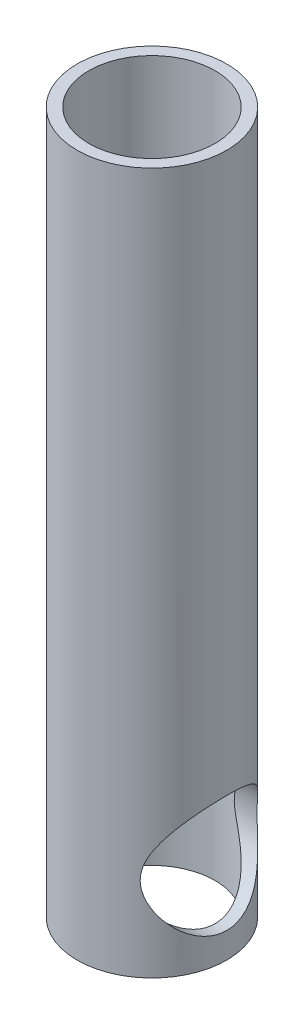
from build123d import *

# Parameters (mm, degrees)
ESQUISSE1_R             = 16
ESQUISSE1_R_2           = 13.5
BOSS_EXTRU_1_DEPTH      = 150
ESQUISSE3_R             = 12.5
ENL_V_MAT_EXTRU_2_DEPTH = 152.69706655


with BuildPart() as part:
    # Esquisse1 → Boss.-Extru.1 (new body)
    with BuildSketch(Plane(origin=(0, 0, 0), x_dir=(1, 0, 0), z_dir=(0, 1, 0))):
        with Locations(Location((0, 0, 0), (0, 0, 270))):
            Circle(ESQUISSE1_R)
        with Locations(Location((0, 0, 0), (0, 0, 270))):
            Circle(ESQUISSE1_R_2, mode=Mode.SUBTRACT)
    extrude(amount=-BOSS_EXTRU_1_DEPTH)

    # Esquisse3 → Enl_v. mat.-Extru.2 (cut, through all)
    with BuildSketch(Plane(origin=(0, 0, 0), x_dir=(0, 0, -1), z_dir=(1, 0, 0))):
        with Locations(Location((0, -132, 0), (0, 0, 180))):
            Circle(ESQUISSE3_R)
    extrude(amount=ENL_V_MAT_EXTRU_2_DEPTH, mode=Mode.SUBTRACT)


solid = part.part
